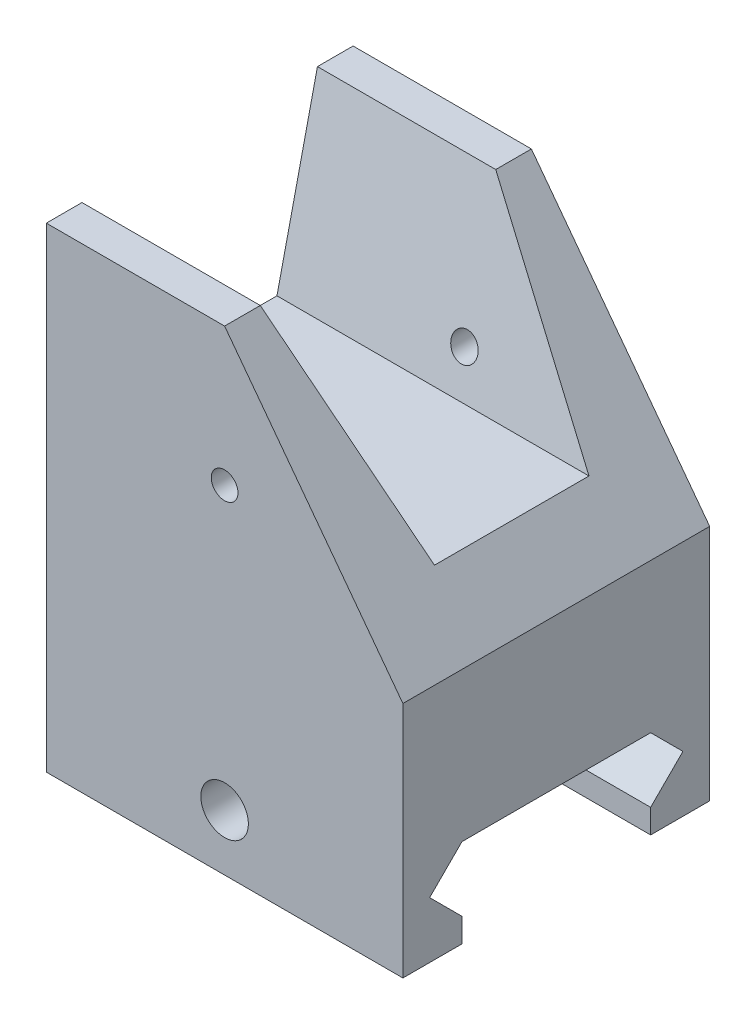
from build123d import *

# Parameters (mm, degrees)
BOSS_EXTRUDE1_DEPTH = 12.905
CUT_EXTRUDE1_DEPTH  = 52.63854205
SKETCH3_R           = 2
SKETCH3_R_2         = 1.125
CUT_EXTRUDE2_DEPTH  = 13


with BuildPart() as part:
    # Sketch1 → Boss-Extrude1 (new, symmetric)
    with BuildSketch(Plane.XY):
        Polygon((30, 0), (0, 0), (0, 40), (15, 40), (30, 20), align=None)
    extrude(amount=BOSS_EXTRUDE1_DEPTH, both=True)

    # Sketch2 → Cut-Extrude1 (cut, through all)
    with BuildSketch(Plane(origin=(0, 0, 0), x_dir=(0, 0, -1), z_dir=(1, 0, 0))):
        Polygon((7.9372, -3e-09), (7.9372, 2.01433523), (10.655, 4.73213523), (7.9372, 7.44993523), (-7.9378, 7.44993523), (-10.6556, 4.73213523), (-7.9378, 2.01433523), (-7.9378, -3e-09), (-7.9378, -1.380141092), (7.9372, -1.380141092), align=None)
        Polygon((9.905, 40), (6.5, 25), (-6.5, 25), (-9.905, 40), (-9.905, 43.829851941), (9.905, 43.829851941), align=None)
    extrude(amount=CUT_EXTRUDE1_DEPTH, mode=Mode.SUBTRACT)

    # Sketch3 → Cut-Extrude2 (cut, symmetric)
    with BuildSketch(Plane.XY):
        with Locations((15, 4.73213523)):
            Circle(SKETCH3_R)
        with Locations((15, 28.399165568)):
            Circle(SKETCH3_R_2)
    extrude(amount=CUT_EXTRUDE2_DEPTH, both=True, mode=Mode.SUBTRACT)


solid = part.part
